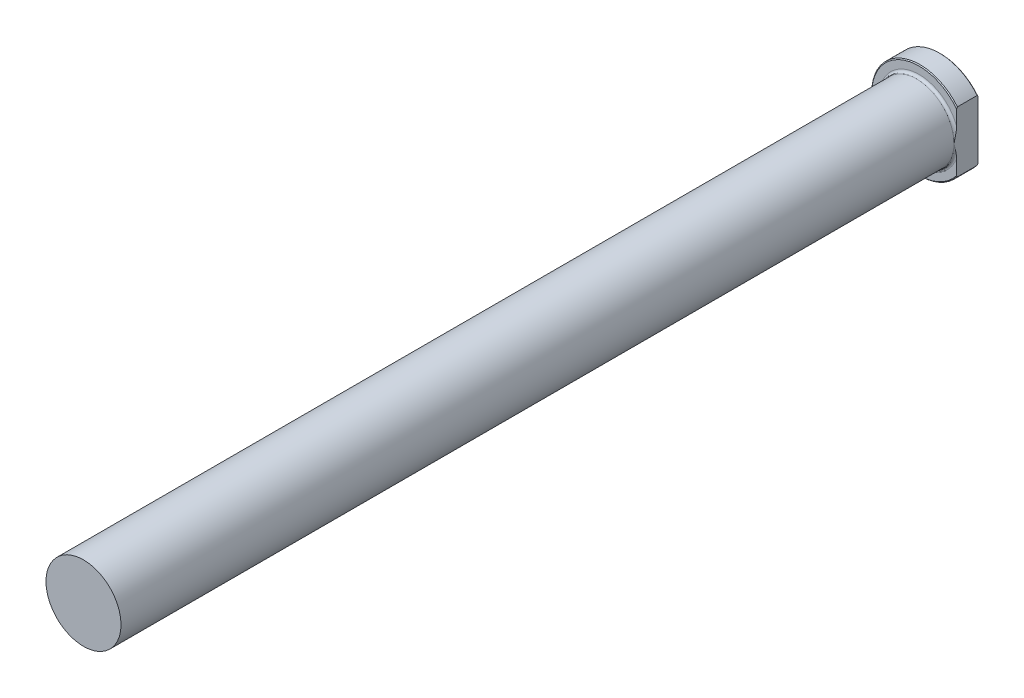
from build123d import *

# Parameters (mm, degrees)
CHAMFER1_SIZE      = 0.254
CUT_EXTRUDE1_REACH = 256.802


with BuildPart() as part:
    # Sketch1 → Revolve1 (revolve)
    with BuildSketch(Plane(origin=(0, 0, 0), x_dir=(0, 0, -1), z_dir=(1, 0, 0)), mode=Mode.PRIVATE) as revolve1_sk:
        with BuildLine():
            Line((0, 0), (0, 14.2875))
            Line((0, 14.2875), (-6.35, 14.2875))
            Line((-6.35, 14.2875), (-6.35, 11.8745))
            ThreePointArc((-6.35, 11.8745), (-6.573184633, 11.335684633), (-7.112, 11.1125))
            Line((-7.112, 11.1125), (-254, 11.1125))
            Line((-254, 11.1125), (-254, 0))
            Line((-254, 0), (0, 0))
        make_face()
    revolve(revolve1_sk.sketch.rotate(Axis((0, 0, -25.434744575), (0, 0, 1)), 90), axis=Axis((0, 0, -25.434744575), (0, 0, 1)))

    # Chamfer1
    chamfer1_edges = [part.edges().sort_by_distance(p)[0] for p in [
        (14.2875, 0, 0),
        (14.2875, 0, 6.35),
    ]]
    chamfer(chamfer1_edges, length=CHAMFER1_SIZE)

    # Sketch2 → Cut-Extrude1 (cut, up to next)
    with BuildSketch(Plane(origin=(0, 0, 0), x_dir=(-1, 0, 0), z_dir=(0, 0, -1)), mode=Mode.PRIVATE) as cut_extrude1_sk1:
        with BuildLine():
            Line((-11.1125, 8.980256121), (-11.1125, -8.980256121))
            ThreePointArc((-11.1125, -8.980256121), (-14.2875, 0), (-11.1125, 8.980256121))
        make_face()
    cut_extrude1_tool1 = extrude(cut_extrude1_sk1.sketch, amount=-CUT_EXTRUDE1_REACH, mode=Mode.PRIVATE) & part.part
    add(cut_extrude1_tool1.solids().sort_by_distance((12.39543, 0, 0))[0], mode=Mode.SUBTRACT)


solid = part.part
